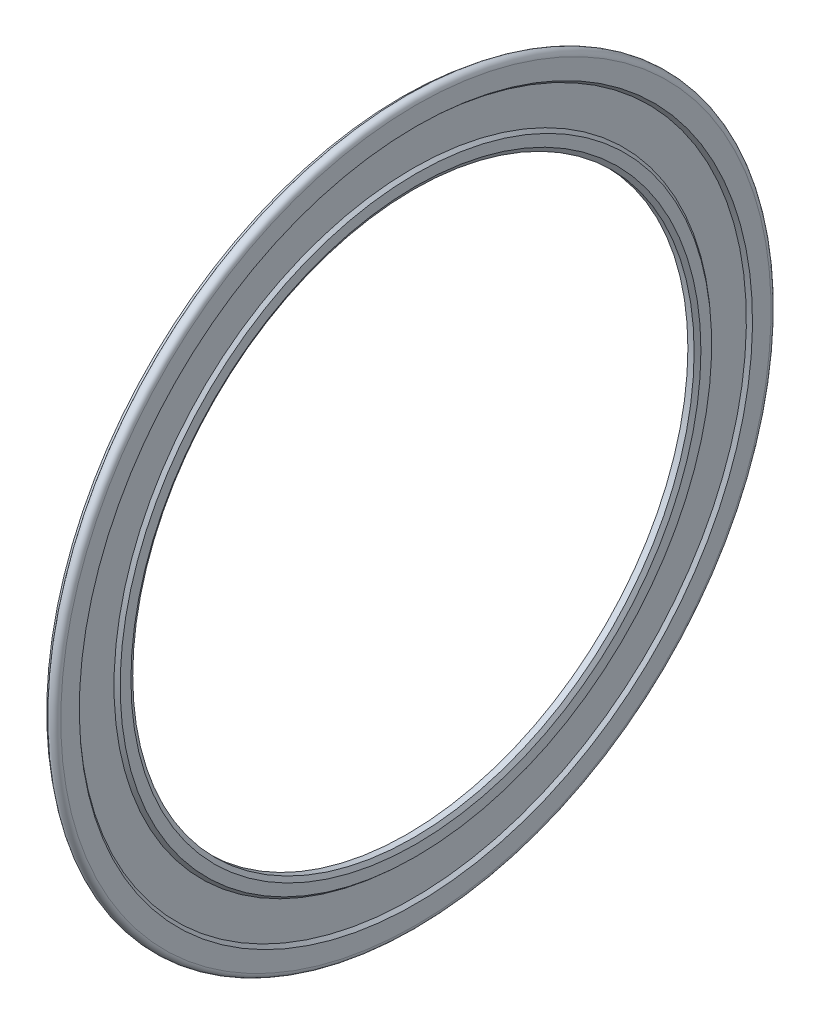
ISO-10303-21;
HEADER;
FILE_DESCRIPTION(('STEP AP214'),'2;1');
FILE_NAME('part.step','',(''),(''),'','','');
FILE_SCHEMA(('AUTOMOTIVE_DESIGN { 1 0 10303 214 1 1 1 1 }'));
ENDSEC;
DATA;
#1=APPLICATION_CONTEXT('core data for automotive mechanical design processes');
#2=APPLICATION_PROTOCOL_DEFINITION('international standard','automotive_design',2000,#1);
#3=PRODUCT_CONTEXT('',#1,'mechanical');
#4=PRODUCT('Part','Part','',(#3));
#5=PRODUCT_RELATED_PRODUCT_CATEGORY('part','',(#4));
#6=PRODUCT_DEFINITION_FORMATION('','',#4);
#7=PRODUCT_DEFINITION_CONTEXT('part definition',#1,'design');
#8=PRODUCT_DEFINITION('design','',#6,#7);
#9=PRODUCT_DEFINITION_SHAPE('','',#8);
#10=(LENGTH_UNIT() NAMED_UNIT(*) SI_UNIT(.MILLI.,.METRE.));
#11=(NAMED_UNIT(*) PLANE_ANGLE_UNIT() SI_UNIT($,.RADIAN.));
#12=(NAMED_UNIT(*) SI_UNIT($,.STERADIAN.) SOLID_ANGLE_UNIT());
#13=UNCERTAINTY_MEASURE_WITH_UNIT(LENGTH_MEASURE(1.E-05),#10,'distance_accuracy_value','');
#14=(GEOMETRIC_REPRESENTATION_CONTEXT(3) GLOBAL_UNCERTAINTY_ASSIGNED_CONTEXT((#13)) GLOBAL_UNIT_ASSIGNED_CONTEXT((#10,
#11,#12)) REPRESENTATION_CONTEXT('',''));
#15=CARTESIAN_POINT('',(0.,0.,0.));
#16=DIRECTION('',(0.,0.,1.));
#17=DIRECTION('',(1.,0.,0.));
#18=AXIS2_PLACEMENT_3D('',#15,#16,#17);
#19=CARTESIAN_POINT('',(0.416666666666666,8.95433756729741,0.));
#20=DIRECTION('',(1.,0.,0.));
#21=DIRECTION('',(0.,1.,0.));
#22=AXIS2_PLACEMENT_3D('',#19,#20,#21);
#23=PLANE('',#22);
#24=CARTESIAN_POINT('',(0.416666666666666,0.,0.));
#25=DIRECTION('',(1.,0.,0.));
#26=DIRECTION('',(0.,1.,0.));
#27=AXIS2_PLACEMENT_3D('',#24,#25,#26);
#28=CIRCLE('',#27,9.12);
#29=CARTESIAN_POINT('',(0.416666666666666,9.12,0.));
#30=VERTEX_POINT('',#29);
#31=EDGE_CURVE('E11',#30,#30,#28,.T.);
#32=ORIENTED_EDGE('',*,*,#31,.T.);
#33=EDGE_LOOP('',(#32));
#34=FACE_BOUND('',#33,.T.);
#35=CARTESIAN_POINT('',(0.416666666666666,0.,0.));
#36=DIRECTION('',(1.,0.,0.));
#37=DIRECTION('',(0.,1.,0.));
#38=AXIS2_PLACEMENT_3D('',#35,#36,#37);
#39=CIRCLE('',#38,8.78867513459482);
#40=CARTESIAN_POINT('',(0.416666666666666,8.78867513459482,0.));
#41=VERTEX_POINT('',#40);
#42=EDGE_CURVE('E96',#41,#41,#39,.T.);
#43=ORIENTED_EDGE('',*,*,#42,.F.);
#44=EDGE_LOOP('',(#43));
#45=FACE_BOUND('',#44,.T.);
#46=ADVANCED_FACE('F17',(#34,#45),#23,.T.);
#47=CARTESIAN_POINT('',(0.366666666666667,0.,0.));
#48=DIRECTION('',(-1.,0.,0.));
#49=DIRECTION('',(0.,1.,0.));
#50=AXIS2_PLACEMENT_3D('',#47,#48,#49);
#51=CONICAL_SURFACE('',#50,9.165,0.732815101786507);
#52=CARTESIAN_POINT('',(0.316666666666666,0.,0.));
#53=DIRECTION('',(1.,0.,0.));
#54=DIRECTION('',(0.,1.,0.));
#55=AXIS2_PLACEMENT_3D('',#52,#53,#54);
#56=CIRCLE('',#55,9.21);
#57=CARTESIAN_POINT('',(0.316666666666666,9.21,0.));
#58=VERTEX_POINT('',#57);
#59=EDGE_CURVE('E27',#58,#58,#56,.T.);
#60=ORIENTED_EDGE('',*,*,#59,.T.);
#61=EDGE_LOOP('',(#60));
#62=FACE_BOUND('',#61,.T.);
#63=ORIENTED_EDGE('',*,*,#31,.F.);
#64=EDGE_LOOP('',(#63));
#65=FACE_BOUND('',#64,.T.);
#66=ADVANCED_FACE('F120',(#62,#65),#51,.T.);
#67=CARTESIAN_POINT('',(0.316666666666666,9.75,0.));
#68=DIRECTION('',(1.,0.,0.));
#69=DIRECTION('',(0.,1.,0.));
#70=AXIS2_PLACEMENT_3D('',#67,#68,#69);
#71=PLANE('',#70);
#72=CARTESIAN_POINT('',(0.316666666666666,0.,0.));
#73=DIRECTION('',(1.,0.,0.));
#74=DIRECTION('',(0.,1.,0.));
#75=AXIS2_PLACEMENT_3D('',#72,#73,#74);
#76=CIRCLE('',#75,10.29);
#77=CARTESIAN_POINT('',(0.316666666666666,10.29,0.));
#78=VERTEX_POINT('',#77);
#79=EDGE_CURVE('E83',#78,#78,#76,.T.);
#80=ORIENTED_EDGE('',*,*,#79,.T.);
#81=EDGE_LOOP('',(#80));
#82=FACE_BOUND('',#81,.T.);
#83=ORIENTED_EDGE('',*,*,#59,.F.);
#84=EDGE_LOOP('',(#83));
#85=FACE_BOUND('',#84,.T.);
#86=ADVANCED_FACE('F124',(#82,#85),#71,.T.);
#87=CARTESIAN_POINT('',(0.366666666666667,0.,0.));
#88=DIRECTION('',(1.,0.,0.));
#89=DIRECTION('',(0.,1.,0.));
#90=AXIS2_PLACEMENT_3D('',#87,#88,#89);
#91=CONICAL_SURFACE('',#90,10.335,0.732815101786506);
#92=CARTESIAN_POINT('',(0.416666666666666,0.,0.));
#93=DIRECTION('',(1.,0.,0.));
#94=DIRECTION('',(0.,1.,0.));
#95=AXIS2_PLACEMENT_3D('',#92,#93,#94);
#96=CIRCLE('',#95,10.38);
#97=CARTESIAN_POINT('',(0.416666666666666,10.38,0.));
#98=VERTEX_POINT('',#97);
#99=EDGE_CURVE('E75',#98,#98,#96,.T.);
#100=ORIENTED_EDGE('',*,*,#99,.T.);
#101=EDGE_LOOP('',(#100));
#102=FACE_BOUND('',#101,.T.);
#103=ORIENTED_EDGE('',*,*,#79,.F.);
#104=EDGE_LOOP('',(#103));
#105=FACE_BOUND('',#104,.T.);
#106=ADVANCED_FACE('F129',(#102,#105),#91,.F.);
#107=CARTESIAN_POINT('',(0.416666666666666,10.6659437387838,0.));
#108=DIRECTION('',(1.,0.,0.));
#109=DIRECTION('',(0.,1.,0.));
#110=AXIS2_PLACEMENT_3D('',#107,#108,#109);
#111=PLANE('',#110);
#112=CARTESIAN_POINT('',(0.416666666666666,0.,0.));
#113=DIRECTION('',(1.,0.,0.));
#114=DIRECTION('',(0.,1.,0.));
#115=AXIS2_PLACEMENT_3D('',#112,#113,#114);
#116=CIRCLE('',#115,10.9518874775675);
#117=CARTESIAN_POINT('',(0.416666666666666,10.9518874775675,0.));
#118=VERTEX_POINT('',#117);
#119=EDGE_CURVE('E21',#118,#118,#116,.T.);
#120=ORIENTED_EDGE('',*,*,#119,.T.);
#121=EDGE_LOOP('',(#120));
#122=FACE_BOUND('',#121,.T.);
#123=ORIENTED_EDGE('',*,*,#99,.F.);
#124=EDGE_LOOP('',(#123));
#125=FACE_BOUND('',#124,.T.);
#126=ADVANCED_FACE('F79',(#122,#125),#111,.T.);
#127=CARTESIAN_POINT('',(0.25,0.,0.));
#128=DIRECTION('',(1.,0.,0.));
#129=DIRECTION('',(0.,0.,-1.));
#130=AXIS2_PLACEMENT_3D('',#127,#128,#129);
#131=TOROIDAL_SURFACE('',#130,10.9518874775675,0.166666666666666);
#132=CARTESIAN_POINT('',(0.0833333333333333,0.,0.));
#133=DIRECTION('',(1.,0.,0.));
#134=DIRECTION('',(0.,1.,0.));
#135=AXIS2_PLACEMENT_3D('',#132,#133,#134);
#136=CIRCLE('',#135,10.9518874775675);
#137=CARTESIAN_POINT('',(0.0833333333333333,10.9518874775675,0.));
#138=VERTEX_POINT('',#137);
#139=EDGE_CURVE('E82',#138,#138,#136,.T.);
#140=ORIENTED_EDGE('',*,*,#139,.T.);
#141=EDGE_LOOP('',(#140));
#142=FACE_BOUND('',#141,.T.);
#143=ORIENTED_EDGE('',*,*,#119,.F.);
#144=EDGE_LOOP('',(#143));
#145=FACE_BOUND('',#144,.T.);
#146=ADVANCED_FACE('F191',(#142,#145),#131,.T.);
#147=CARTESIAN_POINT('',(0.0333333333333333,0.,0.));
#148=DIRECTION('',(-1.,0.,0.));
#149=DIRECTION('',(0.,1.,0.));
#150=AXIS2_PLACEMENT_3D('',#147,#148,#149);
#151=CYLINDRICAL_SURFACE('',#150,10.9518874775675);
#152=CARTESIAN_POINT('',(-0.0166666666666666,0.,0.));
#153=DIRECTION('',(1.,0.,0.));
#154=DIRECTION('',(0.,1.,0.));
#155=AXIS2_PLACEMENT_3D('',#152,#153,#154);
#156=CIRCLE('',#155,10.9518874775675);
#157=CARTESIAN_POINT('',(-0.0166666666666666,10.9518874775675,0.));
#158=VERTEX_POINT('',#157);
#159=EDGE_CURVE('E55',#158,#158,#156,.T.);
#160=ORIENTED_EDGE('',*,*,#159,.T.);
#161=EDGE_LOOP('',(#160));
#162=FACE_BOUND('',#161,.T.);
#163=ORIENTED_EDGE('',*,*,#139,.F.);
#164=EDGE_LOOP('',(#163));
#165=FACE_BOUND('',#164,.T.);
#166=ADVANCED_FACE('F183',(#162,#165),#151,.T.);
#167=CARTESIAN_POINT('',(-0.0166666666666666,10.0954416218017,0.));
#168=DIRECTION('',(-1.,0.,0.));
#169=DIRECTION('',(0.,-1.,0.));
#170=AXIS2_PLACEMENT_3D('',#167,#168,#169);
#171=PLANE('',#170);
#172=CARTESIAN_POINT('',(-0.0166666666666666,0.,0.));
#173=DIRECTION('',(1.,0.,0.));
#174=DIRECTION('',(0.,1.,0.));
#175=AXIS2_PLACEMENT_3D('',#172,#173,#174);
#176=CIRCLE('',#175,9.23899576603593);
#177=CARTESIAN_POINT('',(-0.0166666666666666,9.23899576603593,0.));
#178=VERTEX_POINT('',#177);
#179=EDGE_CURVE('E61',#178,#178,#176,.T.);
#180=ORIENTED_EDGE('',*,*,#179,.T.);
#181=EDGE_LOOP('',(#180));
#182=FACE_BOUND('',#181,.T.);
#183=ORIENTED_EDGE('',*,*,#159,.F.);
#184=EDGE_LOOP('',(#183));
#185=FACE_BOUND('',#184,.T.);
#186=ADVANCED_FACE('F138',(#182,#185),#171,.T.);
#187=CARTESIAN_POINT('',(0.116666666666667,0.,0.));
#188=DIRECTION('',(-1.,0.,0.));
#189=DIRECTION('',(0.,1.,0.));
#190=AXIS2_PLACEMENT_3D('',#187,#188,#189);
#191=CONICAL_SURFACE('',#190,9.11899576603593,0.732815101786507);
#192=CARTESIAN_POINT('',(0.25,0.,0.));
#193=DIRECTION('',(1.,0.,0.));
#194=DIRECTION('',(0.,1.,0.));
#195=AXIS2_PLACEMENT_3D('',#192,#193,#194);
#196=CIRCLE('',#195,8.99899576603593);
#197=CARTESIAN_POINT('',(0.25,8.99899576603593,0.));
#198=VERTEX_POINT('',#197);
#199=EDGE_CURVE('E65',#198,#198,#196,.T.);
#200=ORIENTED_EDGE('',*,*,#199,.T.);
#201=EDGE_LOOP('',(#200));
#202=FACE_BOUND('',#201,.T.);
#203=ORIENTED_EDGE('',*,*,#179,.F.);
#204=EDGE_LOOP('',(#203));
#205=FACE_BOUND('',#204,.T.);
#206=ADVANCED_FACE('F135',(#202,#205),#191,.F.);
#207=CARTESIAN_POINT('',(0.25,8.91616454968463,0.));
#208=DIRECTION('',(-1.,0.,0.));
#209=DIRECTION('',(0.,-1.,0.));
#210=AXIS2_PLACEMENT_3D('',#207,#208,#209);
#211=PLANE('',#210);
#212=CARTESIAN_POINT('',(0.25,0.,0.));
#213=DIRECTION('',(1.,0.,0.));
#214=DIRECTION('',(0.,1.,0.));
#215=AXIS2_PLACEMENT_3D('',#212,#213,#214);
#216=CIRCLE('',#215,8.83333333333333);
#217=CARTESIAN_POINT('',(0.25,8.83333333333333,0.));
#218=VERTEX_POINT('',#217);
#219=EDGE_CURVE('E92',#218,#218,#216,.T.);
#220=ORIENTED_EDGE('',*,*,#219,.T.);
#221=EDGE_LOOP('',(#220));
#222=FACE_BOUND('',#221,.T.);
#223=ORIENTED_EDGE('',*,*,#199,.F.);
#224=EDGE_LOOP('',(#223));
#225=FACE_BOUND('',#224,.T.);
#226=ADVANCED_FACE('F137',(#222,#225),#211,.T.);
#227=CARTESIAN_POINT('',(0.198858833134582,0.,0.));
#228=DIRECTION('',(1.,0.,0.));
#229=DIRECTION('',(0.,1.,0.));
#230=AXIS2_PLACEMENT_3D('',#227,#228,#229);
#231=CONICAL_SURFACE('',#230,8.74475423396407,1.0471975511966);
#232=CARTESIAN_POINT('',(0.147717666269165,0.,0.));
#233=DIRECTION('',(1.,0.,0.));
#234=DIRECTION('',(0.,1.,0.));
#235=AXIS2_PLACEMENT_3D('',#232,#233,#234);
#236=CIRCLE('',#235,8.65617513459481);
#237=CARTESIAN_POINT('',(0.147717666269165,8.65617513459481,0.));
#238=VERTEX_POINT('',#237);
#239=EDGE_CURVE('E93',#238,#238,#236,.T.);
#240=ORIENTED_EDGE('',*,*,#239,.T.);
#241=EDGE_LOOP('',(#240));
#242=FACE_BOUND('',#241,.T.);
#243=ORIENTED_EDGE('',*,*,#219,.F.);
#244=EDGE_LOOP('',(#243));
#245=FACE_BOUND('',#244,.T.);
#246=ADVANCED_FACE('F19',(#242,#245),#231,.T.);
#247=CARTESIAN_POINT('',(0.243942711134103,0.,0.));
#248=DIRECTION('',(-1.,0.,0.));
#249=DIRECTION('',(0.,1.,0.));
#250=AXIS2_PLACEMENT_3D('',#247,#248,#249);
#251=CYLINDRICAL_SURFACE('',#250,8.65617513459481);
#252=CARTESIAN_POINT('',(0.34016775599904,0.,0.));
#253=DIRECTION('',(1.,0.,0.));
#254=DIRECTION('',(0.,1.,0.));
#255=AXIS2_PLACEMENT_3D('',#252,#253,#254);
#256=CIRCLE('',#255,8.65617513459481);
#257=CARTESIAN_POINT('',(0.34016775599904,8.65617513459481,0.));
#258=VERTEX_POINT('',#257);
#259=EDGE_CURVE('E100',#258,#258,#256,.T.);
#260=ORIENTED_EDGE('',*,*,#259,.T.);
#261=EDGE_LOOP('',(#260));
#262=FACE_BOUND('',#261,.T.);
#263=ORIENTED_EDGE('',*,*,#239,.F.);
#264=EDGE_LOOP('',(#263));
#265=FACE_BOUND('',#264,.T.);
#266=ADVANCED_FACE('F106',(#262,#265),#251,.F.);
#267=CARTESIAN_POINT('',(0.378417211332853,0.,0.));
#268=DIRECTION('',(1.,0.,0.));
#269=DIRECTION('',(0.,1.,0.));
#270=AXIS2_PLACEMENT_3D('',#267,#268,#269);
#271=CONICAL_SURFACE('',#270,8.72242513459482,1.0471975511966);
#272=ORIENTED_EDGE('',*,*,#42,.T.);
#273=EDGE_LOOP('',(#272));
#274=FACE_BOUND('',#273,.T.);
#275=ORIENTED_EDGE('',*,*,#259,.F.);
#276=EDGE_LOOP('',(#275));
#277=FACE_BOUND('',#276,.T.);
#278=ADVANCED_FACE('F109',(#274,#277),#271,.F.);
#279=CLOSED_SHELL('',(#46,#66,#86,#106,#126,#146,#166,#186,#206,#226,#246,#266,#278));
#280=MANIFOLD_SOLID_BREP('B1',#279);
#281=ADVANCED_BREP_SHAPE_REPRESENTATION('',(#18,#280),#14);
#282=SHAPE_DEFINITION_REPRESENTATION(#9,#281);
ENDSEC;
END-ISO-10303-21;
